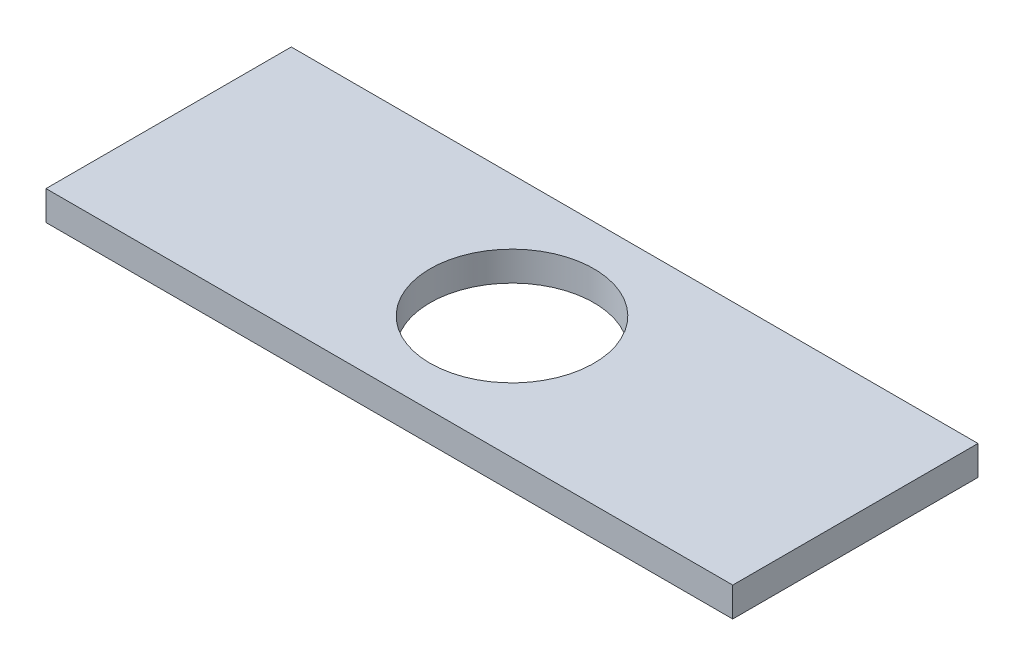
from build123d import *

# Parameters (mm, degrees)
SKETCH1_W      = 140
SKETCH1_H      = 50
SKETCH1_R      = 16.7
EXTRUDE1_DEPTH = 6


with BuildPart() as part:
    # Sketch1 → Extrude1 (new body)
    with BuildSketch(Plane(origin=(0, 0, 0), x_dir=(1, 0, 0), z_dir=(0, 1, 0))):
        Rectangle(SKETCH1_W, SKETCH1_H)
        with Locations(Location((0, 0, 0), (0, 0, 270))):
            Circle(SKETCH1_R, mode=Mode.SUBTRACT)
    extrude(amount=EXTRUDE1_DEPTH)


solid = part.part
